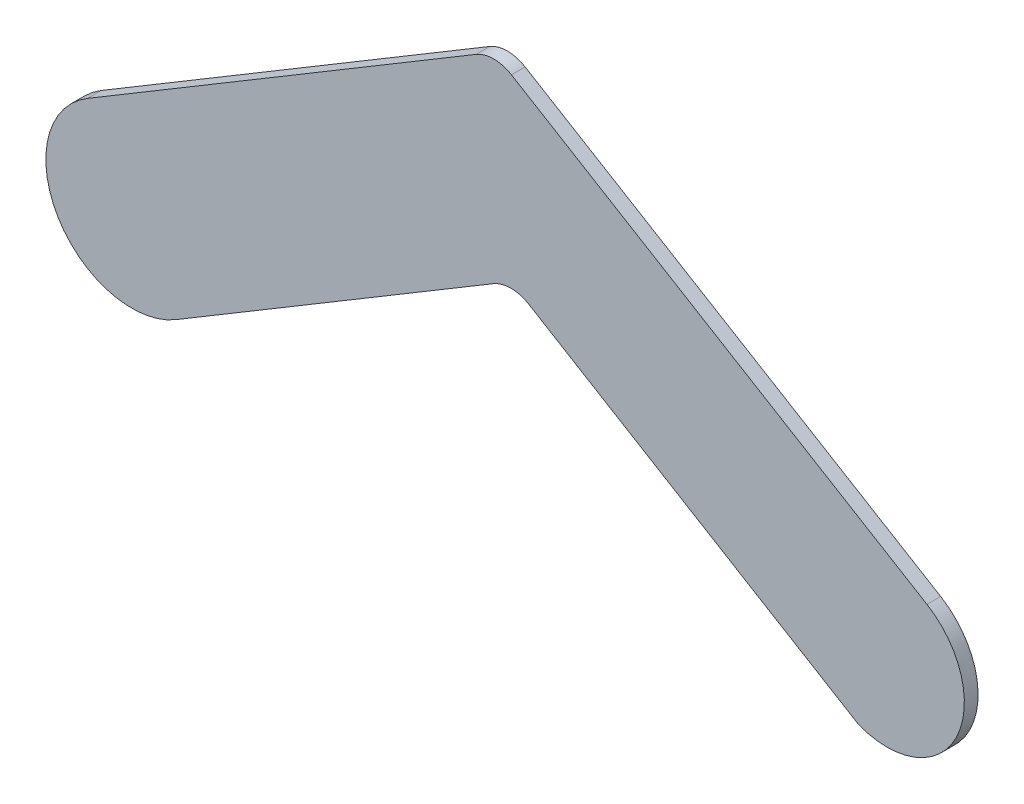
ISO-10303-21;
HEADER;
FILE_DESCRIPTION(('STEP AP214'),'2;1');
FILE_NAME('part.step','',(''),(''),'','','');
FILE_SCHEMA(('AUTOMOTIVE_DESIGN { 1 0 10303 214 1 1 1 1 }'));
ENDSEC;
DATA;
#1=APPLICATION_CONTEXT('core data for automotive mechanical design processes');
#2=APPLICATION_PROTOCOL_DEFINITION('international standard','automotive_design',2000,#1);
#3=PRODUCT_CONTEXT('',#1,'mechanical');
#4=PRODUCT('Part','Part','',(#3));
#5=PRODUCT_RELATED_PRODUCT_CATEGORY('part','',(#4));
#6=PRODUCT_DEFINITION_FORMATION('','',#4);
#7=PRODUCT_DEFINITION_CONTEXT('part definition',#1,'design');
#8=PRODUCT_DEFINITION('design','',#6,#7);
#9=PRODUCT_DEFINITION_SHAPE('','',#8);
#10=(LENGTH_UNIT() NAMED_UNIT(*) SI_UNIT(.MILLI.,.METRE.));
#11=(NAMED_UNIT(*) PLANE_ANGLE_UNIT() SI_UNIT($,.RADIAN.));
#12=(NAMED_UNIT(*) SI_UNIT($,.STERADIAN.) SOLID_ANGLE_UNIT());
#13=UNCERTAINTY_MEASURE_WITH_UNIT(LENGTH_MEASURE(1.E-05),#10,'distance_accuracy_value','');
#14=(GEOMETRIC_REPRESENTATION_CONTEXT(3) GLOBAL_UNCERTAINTY_ASSIGNED_CONTEXT((#13)) GLOBAL_UNIT_ASSIGNED_CONTEXT((#10,
#11,#12)) REPRESENTATION_CONTEXT('',''));
#15=CARTESIAN_POINT('',(0.,0.,0.));
#16=DIRECTION('',(0.,0.,1.));
#17=DIRECTION('',(1.,0.,0.));
#18=AXIS2_PLACEMENT_3D('',#15,#16,#17);
#19=CARTESIAN_POINT('',(-31.0559179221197,41.0108490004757,-4.38));
#20=DIRECTION('',(-0.513309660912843,0.858203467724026,0.));
#21=DIRECTION('',(-0.858203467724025,-0.513309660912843,0.));
#22=AXIS2_PLACEMENT_3D('',#19,#20,#21);
#23=PLANE('',#22);
#24=DIRECTION('',(-0.858203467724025,-0.513309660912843,0.));
#25=VECTOR('',#24,1.);
#26=CARTESIAN_POINT('',(-31.0559179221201,41.0108490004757,0.379999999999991));
#27=LINE('',#26,#25);
#28=CARTESIAN_POINT('',(2.07394062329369,60.8265187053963,0.380000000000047));
#29=VERTEX_POINT('',#28);
#30=CARTESIAN_POINT('',(-108.176469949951,-5.11658569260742,0.380000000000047));
#31=VERTEX_POINT('',#30);
#32=EDGE_CURVE('E132',#29,#31,#27,.T.);
#33=ORIENTED_EDGE('',*,*,#32,.T.);
#34=DIRECTION('',(0.,0.,1.));
#35=VECTOR('',#34,1.);
#36=CARTESIAN_POINT('',(-108.176469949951,-5.11658569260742,-4.37999999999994));
#37=LINE('',#36,#35);
#38=CARTESIAN_POINT('',(-108.176469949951,-5.11658569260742,-4.37999999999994));
#39=VERTEX_POINT('',#38);
#40=EDGE_CURVE('E11',#39,#31,#37,.T.);
#41=ORIENTED_EDGE('',*,*,#40,.F.);
#42=DIRECTION('',(-0.858203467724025,-0.513309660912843,0.));
#43=VECTOR('',#42,1.);
#44=CARTESIAN_POINT('',(-31.0559179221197,41.0108490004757,-4.38));
#45=LINE('',#44,#43);
#46=CARTESIAN_POINT('',(2.07394062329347,60.8265187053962,-4.37999999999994));
#47=VERTEX_POINT('',#46);
#48=EDGE_CURVE('E54',#47,#39,#45,.T.);
#49=ORIENTED_EDGE('',*,*,#48,.F.);
#50=DIRECTION('',(0.,0.,1.));
#51=VECTOR('',#50,1.);
#52=CARTESIAN_POINT('',(2.07394062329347,60.8265187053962,-4.37999999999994));
#53=LINE('',#52,#51);
#54=EDGE_CURVE('E39',#47,#29,#53,.T.);
#55=ORIENTED_EDGE('',*,*,#54,.T.);
#56=EDGE_LOOP('',(#33,#41,#49,#55));
#57=FACE_BOUND('',#56,.T.);
#58=ADVANCED_FACE('F36',(#57),#23,.F.);
#59=CARTESIAN_POINT('',(-123.542382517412,20.4840522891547,-4.38));
#60=DIRECTION('',(0.,0.,1.));
#61=DIRECTION('',(1.,0.,0.));
#62=AXIS2_PLACEMENT_3D('',#59,#60,#61);
#63=CYLINDRICAL_SURFACE('',#62,29.8580631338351);
#64=CARTESIAN_POINT('',(-123.542382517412,20.4840522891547,0.380000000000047));
#65=DIRECTION('',(0.,0.,1.));
#66=DIRECTION('',(1.,0.,0.));
#67=AXIS2_PLACEMENT_3D('',#64,#65,#66);
#68=CIRCLE('',#67,29.8580631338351);
#69=CARTESIAN_POINT('',(-138.908295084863,46.0846902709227,0.380000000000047));
#70=VERTEX_POINT('',#69);
#71=EDGE_CURVE('E149',#70,#31,#68,.T.);
#72=ORIENTED_EDGE('',*,*,#71,.F.);
#73=DIRECTION('',(0.,0.,1.));
#74=VECTOR('',#73,1.);
#75=CARTESIAN_POINT('',(-138.908295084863,46.0846902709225,-4.37999999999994));
#76=LINE('',#75,#74);
#77=CARTESIAN_POINT('',(-138.908295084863,46.0846902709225,-4.37999999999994));
#78=VERTEX_POINT('',#77);
#79=EDGE_CURVE('E45',#78,#70,#76,.T.);
#80=ORIENTED_EDGE('',*,*,#79,.F.);
#81=CARTESIAN_POINT('',(-123.542382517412,20.4840522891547,-4.38));
#82=DIRECTION('',(0.,0.,1.));
#83=DIRECTION('',(1.,0.,0.));
#84=AXIS2_PLACEMENT_3D('',#81,#82,#83);
#85=CIRCLE('',#84,29.8580631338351);
#86=EDGE_CURVE('E112',#78,#39,#85,.T.);
#87=ORIENTED_EDGE('',*,*,#86,.T.);
#88=ORIENTED_EDGE('',*,*,#40,.T.);
#89=EDGE_LOOP('',(#72,#80,#87,#88));
#90=FACE_BOUND('',#89,.T.);
#91=ADVANCED_FACE('F176',(#90),#63,.T.);
#92=CARTESIAN_POINT('',(-61.708746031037,92.2593747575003,-4.38));
#93=DIRECTION('',(0.513309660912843,-0.858203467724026,0.));
#94=DIRECTION('',(0.858203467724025,0.513309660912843,0.));
#95=AXIS2_PLACEMENT_3D('',#92,#93,#94);
#96=PLANE('',#95);
#97=DIRECTION('',(0.858203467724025,0.513309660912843,0.));
#98=VECTOR('',#97,1.);
#99=CARTESIAN_POINT('',(-61.7087460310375,92.2593747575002,0.379999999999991));
#100=LINE('',#99,#98);
#101=CARTESIAN_POINT('',(-3.91712264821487,126.82576806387,0.380000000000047));
#102=VERTEX_POINT('',#101);
#103=EDGE_CURVE('E117',#70,#102,#100,.T.);
#104=ORIENTED_EDGE('',*,*,#103,.T.);
#105=DIRECTION('',(0.,0.,1.));
#106=VECTOR('',#105,1.);
#107=CARTESIAN_POINT('',(-3.91712264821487,126.82576806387,-4.38));
#108=LINE('',#107,#106);
#109=CARTESIAN_POINT('',(-3.91712264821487,126.82576806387,-4.38));
#110=VERTEX_POINT('',#109);
#111=EDGE_CURVE('E115',#110,#102,#108,.T.);
#112=ORIENTED_EDGE('',*,*,#111,.F.);
#113=DIRECTION('',(0.858203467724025,0.513309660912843,0.));
#114=VECTOR('',#113,1.);
#115=CARTESIAN_POINT('',(-61.708746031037,92.2593747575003,-4.38));
#116=LINE('',#115,#114);
#117=EDGE_CURVE('E106',#78,#110,#116,.T.);
#118=ORIENTED_EDGE('',*,*,#117,.F.);
#119=ORIENTED_EDGE('',*,*,#79,.T.);
#120=EDGE_LOOP('',(#104,#112,#118,#119));
#121=FACE_BOUND('',#120,.T.);
#122=ADVANCED_FACE('F116',(#121),#96,.F.);
#123=CARTESIAN_POINT('',(2.19126231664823,116.613146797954,-4.38));
#124=DIRECTION('',(0.,0.,1.));
#125=DIRECTION('',(1.,0.,0.));
#126=AXIS2_PLACEMENT_3D('',#123,#124,#125);
#127=CYLINDRICAL_SURFACE('',#126,11.9);
#128=CARTESIAN_POINT('',(2.19126231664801,116.613146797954,0.380000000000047));
#129=DIRECTION('',(0.,0.,1.));
#130=DIRECTION('',(1.,0.,0.));
#131=AXIS2_PLACEMENT_3D('',#128,#129,#130);
#132=CIRCLE('',#131,11.9);
#133=CARTESIAN_POINT('',(8.3407586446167,126.801065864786,0.380000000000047));
#134=VERTEX_POINT('',#133);
#135=EDGE_CURVE('E146',#102,#134,#132,.F.);
#136=ORIENTED_EDGE('',*,*,#135,.T.);
#137=DIRECTION('',(0.,0.,1.));
#138=VECTOR('',#137,1.);
#139=CARTESIAN_POINT('',(8.3407586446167,126.801065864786,-4.38));
#140=LINE('',#139,#138);
#141=CARTESIAN_POINT('',(8.3407586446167,126.801065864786,-4.38));
#142=VERTEX_POINT('',#141);
#143=EDGE_CURVE('E120',#142,#134,#140,.T.);
#144=ORIENTED_EDGE('',*,*,#143,.F.);
#145=CARTESIAN_POINT('',(2.19126231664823,116.613146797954,-4.38));
#146=DIRECTION('',(0.,0.,1.));
#147=DIRECTION('',(1.,0.,0.));
#148=AXIS2_PLACEMENT_3D('',#145,#146,#147);
#149=CIRCLE('',#148,11.9);
#150=EDGE_CURVE('E110',#110,#142,#149,.F.);
#151=ORIENTED_EDGE('',*,*,#150,.F.);
#152=ORIENTED_EDGE('',*,*,#111,.T.);
#153=EDGE_LOOP('',(#136,#144,#151,#152));
#154=FACE_BOUND('',#153,.T.);
#155=ADVANCED_FACE('F122',(#154),#127,.T.);
#156=CARTESIAN_POINT('',(62.4400494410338,94.1463708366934,-4.37999999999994));
#157=DIRECTION('',(-0.516764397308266,-0.856127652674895,0.));
#158=DIRECTION('',(0.856127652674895,-0.516764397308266,0.));
#159=AXIS2_PLACEMENT_3D('',#156,#157,#158);
#160=PLANE('',#159);
#161=DIRECTION('',(0.856127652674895,-0.516764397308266,0.));
#162=VECTOR('',#161,1.);
#163=CARTESIAN_POINT('',(62.440049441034,94.1463708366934,0.380000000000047));
#164=LINE('',#163,#162);
#165=CARTESIAN_POINT('',(152.699115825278,39.6653925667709,0.380000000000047));
#166=VERTEX_POINT('',#165);
#167=EDGE_CURVE('E143',#134,#166,#164,.T.);
#168=ORIENTED_EDGE('',*,*,#167,.T.);
#169=DIRECTION('',(0.,0.,1.));
#170=VECTOR('',#169,1.);
#171=CARTESIAN_POINT('',(152.699115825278,39.6653925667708,-4.38));
#172=LINE('',#171,#170);
#173=CARTESIAN_POINT('',(152.699115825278,39.6653925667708,-4.38));
#174=VERTEX_POINT('',#173);
#175=EDGE_CURVE('E154',#174,#166,#172,.T.);
#176=ORIENTED_EDGE('',*,*,#175,.F.);
#177=DIRECTION('',(0.856127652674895,-0.516764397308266,0.));
#178=VECTOR('',#177,1.);
#179=CARTESIAN_POINT('',(62.4400494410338,94.1463708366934,-4.37999999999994));
#180=LINE('',#179,#178);
#181=EDGE_CURVE('E125',#142,#174,#180,.T.);
#182=ORIENTED_EDGE('',*,*,#181,.F.);
#183=ORIENTED_EDGE('',*,*,#143,.T.);
#184=EDGE_LOOP('',(#168,#176,#182,#183));
#185=FACE_BOUND('',#184,.T.);
#186=ADVANCED_FACE('F189',(#185),#160,.F.);
#187=CARTESIAN_POINT('',(138.802049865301,16.642013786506,-4.37999999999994));
#188=DIRECTION('',(0.,0.,1.));
#189=DIRECTION('',(1.,0.,0.));
#190=AXIS2_PLACEMENT_3D('',#187,#188,#189);
#191=CYLINDRICAL_SURFACE('',#190,26.8924601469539);
#192=CARTESIAN_POINT('',(138.802049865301,16.642013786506,0.380000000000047));
#193=DIRECTION('',(0.,0.,1.));
#194=DIRECTION('',(1.,0.,0.));
#195=AXIS2_PLACEMENT_3D('',#192,#193,#194);
#196=CIRCLE('',#195,26.8924601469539);
#197=CARTESIAN_POINT('',(128.941994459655,-8.37765288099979,0.379999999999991));
#198=VERTEX_POINT('',#197);
#199=EDGE_CURVE('E140',#198,#166,#196,.T.);
#200=ORIENTED_EDGE('',*,*,#199,.F.);
#201=DIRECTION('',(0.,0.,1.));
#202=VECTOR('',#201,1.);
#203=CARTESIAN_POINT('',(128.941994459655,-8.37765288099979,-4.38));
#204=LINE('',#203,#202);
#205=CARTESIAN_POINT('',(128.941994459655,-8.37765288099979,-4.38));
#206=VERTEX_POINT('',#205);
#207=EDGE_CURVE('E156',#206,#198,#204,.T.);
#208=ORIENTED_EDGE('',*,*,#207,.F.);
#209=CARTESIAN_POINT('',(138.802049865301,16.642013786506,-4.37999999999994));
#210=DIRECTION('',(0.,0.,1.));
#211=DIRECTION('',(1.,0.,0.));
#212=AXIS2_PLACEMENT_3D('',#209,#210,#211);
#213=CIRCLE('',#212,26.8924601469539);
#214=EDGE_CURVE('E127',#206,#174,#213,.T.);
#215=ORIENTED_EDGE('',*,*,#214,.T.);
#216=ORIENTED_EDGE('',*,*,#175,.T.);
#217=EDGE_LOOP('',(#200,#208,#215,#216));
#218=FACE_BOUND('',#217,.T.);
#219=ADVANCED_FACE('F172',(#218),#191,.T.);
#220=CARTESIAN_POINT('',(34.8407925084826,48.4224642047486,-4.37999999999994));
#221=DIRECTION('',(0.516764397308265,0.856127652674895,0.));
#222=DIRECTION('',(-0.856127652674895,0.516764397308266,0.));
#223=AXIS2_PLACEMENT_3D('',#220,#221,#222);
#224=PLANE('',#223);
#225=DIRECTION('',(-0.856127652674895,0.516764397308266,0.));
#226=VECTOR('',#225,1.);
#227=CARTESIAN_POINT('',(34.8407925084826,48.4224642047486,0.379999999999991));
#228=LINE('',#227,#226);
#229=CARTESIAN_POINT('',(14.3318219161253,60.8018165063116,0.379999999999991));
#230=VERTEX_POINT('',#229);
#231=EDGE_CURVE('E137',#198,#230,#228,.T.);
#232=ORIENTED_EDGE('',*,*,#231,.T.);
#233=DIRECTION('',(0.,0.,1.));
#234=VECTOR('',#233,1.);
#235=CARTESIAN_POINT('',(14.3318219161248,60.8018165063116,-4.38));
#236=LINE('',#235,#234);
#237=CARTESIAN_POINT('',(14.3318219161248,60.8018165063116,-4.38));
#238=VERTEX_POINT('',#237);
#239=EDGE_CURVE('E157',#238,#230,#236,.T.);
#240=ORIENTED_EDGE('',*,*,#239,.F.);
#241=DIRECTION('',(-0.856127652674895,0.516764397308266,0.));
#242=VECTOR('',#241,1.);
#243=CARTESIAN_POINT('',(34.8407925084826,48.4224642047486,-4.37999999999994));
#244=LINE('',#243,#242);
#245=EDGE_CURVE('E202',#206,#238,#244,.T.);
#246=ORIENTED_EDGE('',*,*,#245,.F.);
#247=ORIENTED_EDGE('',*,*,#207,.T.);
#248=EDGE_LOOP('',(#232,#240,#246,#247));
#249=FACE_BOUND('',#248,.T.);
#250=ADVANCED_FACE('F166',(#249),#224,.F.);
#251=CARTESIAN_POINT('',(8.18232558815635,50.6138974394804,-4.37999999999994));
#252=DIRECTION('',(0.,0.,1.));
#253=DIRECTION('',(1.,0.,0.));
#254=AXIS2_PLACEMENT_3D('',#251,#252,#253);
#255=CYLINDRICAL_SURFACE('',#254,11.9);
#256=CARTESIAN_POINT('',(8.18232558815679,50.6138974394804,0.379999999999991));
#257=DIRECTION('',(0.,0.,1.));
#258=DIRECTION('',(1.,0.,0.));
#259=AXIS2_PLACEMENT_3D('',#256,#257,#258);
#260=CIRCLE('',#259,11.9);
#261=EDGE_CURVE('E134',#29,#230,#260,.F.);
#262=ORIENTED_EDGE('',*,*,#261,.F.);
#263=ORIENTED_EDGE('',*,*,#54,.F.);
#264=CARTESIAN_POINT('',(8.18232558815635,50.6138974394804,-4.37999999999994));
#265=DIRECTION('',(0.,0.,1.));
#266=DIRECTION('',(1.,0.,0.));
#267=AXIS2_PLACEMENT_3D('',#264,#265,#266);
#268=CIRCLE('',#267,11.9);
#269=EDGE_CURVE('E204',#47,#238,#268,.F.);
#270=ORIENTED_EDGE('',*,*,#269,.T.);
#271=ORIENTED_EDGE('',*,*,#239,.T.);
#272=EDGE_LOOP('',(#262,#263,#270,#271));
#273=FACE_BOUND('',#272,.T.);
#274=ADVANCED_FACE('F164',(#273),#255,.F.);
#275=CARTESIAN_POINT('',(-0.484602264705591,-10.1013959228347,-4.38));
#276=DIRECTION('',(0.,0.,1.));
#277=DIRECTION('',(1.,0.,0.));
#278=AXIS2_PLACEMENT_3D('',#275,#276,#277);
#279=PLANE('',#278);
#280=ORIENTED_EDGE('',*,*,#48,.T.);
#281=ORIENTED_EDGE('',*,*,#86,.F.);
#282=ORIENTED_EDGE('',*,*,#117,.T.);
#283=ORIENTED_EDGE('',*,*,#150,.T.);
#284=ORIENTED_EDGE('',*,*,#181,.T.);
#285=ORIENTED_EDGE('',*,*,#214,.F.);
#286=ORIENTED_EDGE('',*,*,#245,.T.);
#287=ORIENTED_EDGE('',*,*,#269,.F.);
#288=EDGE_LOOP('',(#280,#281,#282,#283,#284,#285,#286,#287));
#289=FACE_BOUND('',#288,.T.);
#290=ADVANCED_FACE('F108',(#289),#279,.F.);
#291=CARTESIAN_POINT('',(-0.484602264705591,-10.1013959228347,0.379999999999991));
#292=DIRECTION('',(0.,0.,1.));
#293=DIRECTION('',(1.,0.,0.));
#294=AXIS2_PLACEMENT_3D('',#291,#292,#293);
#295=PLANE('',#294);
#296=ORIENTED_EDGE('',*,*,#32,.F.);
#297=ORIENTED_EDGE('',*,*,#261,.T.);
#298=ORIENTED_EDGE('',*,*,#231,.F.);
#299=ORIENTED_EDGE('',*,*,#199,.T.);
#300=ORIENTED_EDGE('',*,*,#167,.F.);
#301=ORIENTED_EDGE('',*,*,#135,.F.);
#302=ORIENTED_EDGE('',*,*,#103,.F.);
#303=ORIENTED_EDGE('',*,*,#71,.T.);
#304=EDGE_LOOP('',(#296,#297,#298,#299,#300,#301,#302,#303));
#305=FACE_BOUND('',#304,.T.);
#306=ADVANCED_FACE('F162',(#305),#295,.T.);
#307=CLOSED_SHELL('',(#58,#91,#122,#155,#186,#219,#250,#274,#290,#306));
#308=MANIFOLD_SOLID_BREP('B2',#307);
#309=ADVANCED_BREP_SHAPE_REPRESENTATION('',(#18,#308),#14);
#310=SHAPE_DEFINITION_REPRESENTATION(#9,#309);
ENDSEC;
END-ISO-10303-21;
